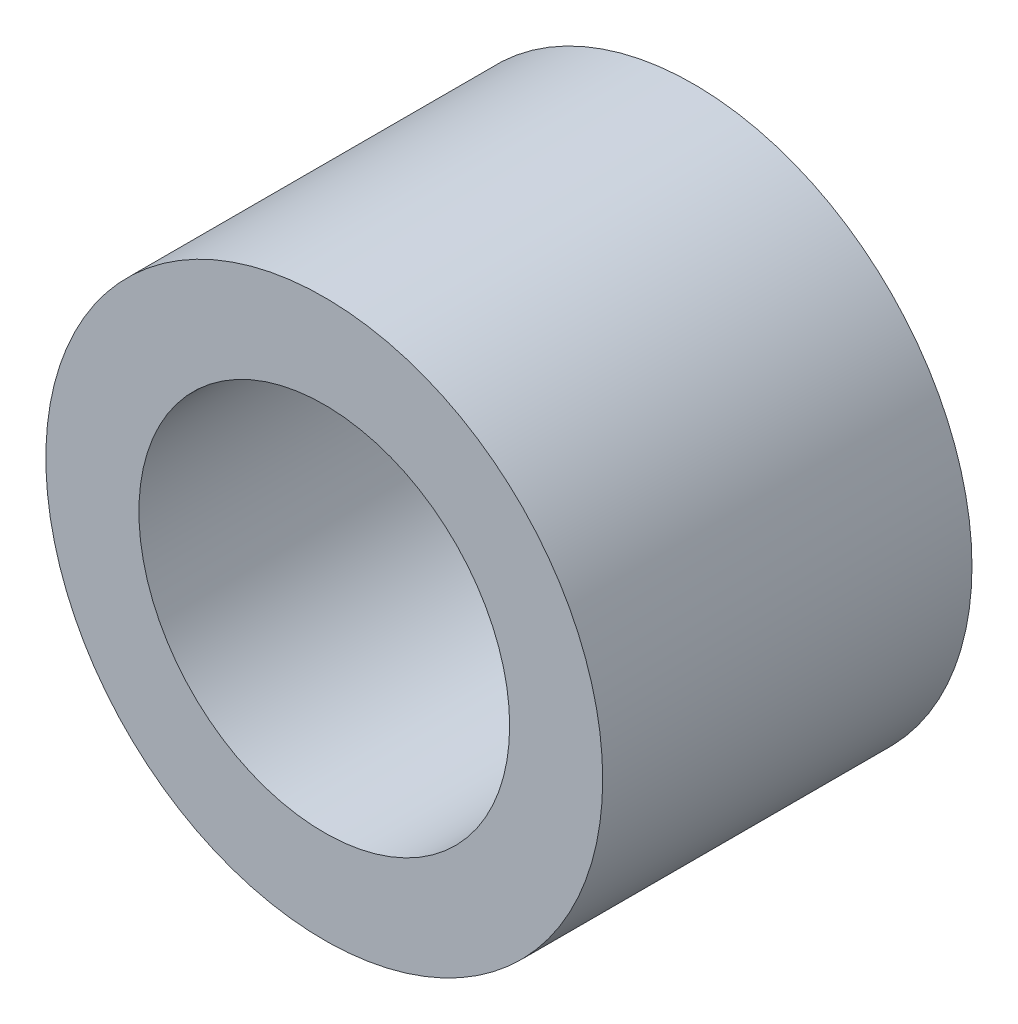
from build123d import *

# Parameters (mm, degrees)
SKETCH1_R      = 4.7879
SKETCH1_R_2    = 3.1877
EXTRUDE1_DEPTH = 3.175


with BuildPart() as part:
    # Sketch1 → Extrude1 (new, symmetric)
    with BuildSketch(Plane.XY):
        Circle(SKETCH1_R)
        Circle(SKETCH1_R_2, mode=Mode.SUBTRACT)
    extrude(amount=EXTRUDE1_DEPTH, both=True)


solid = part.part
